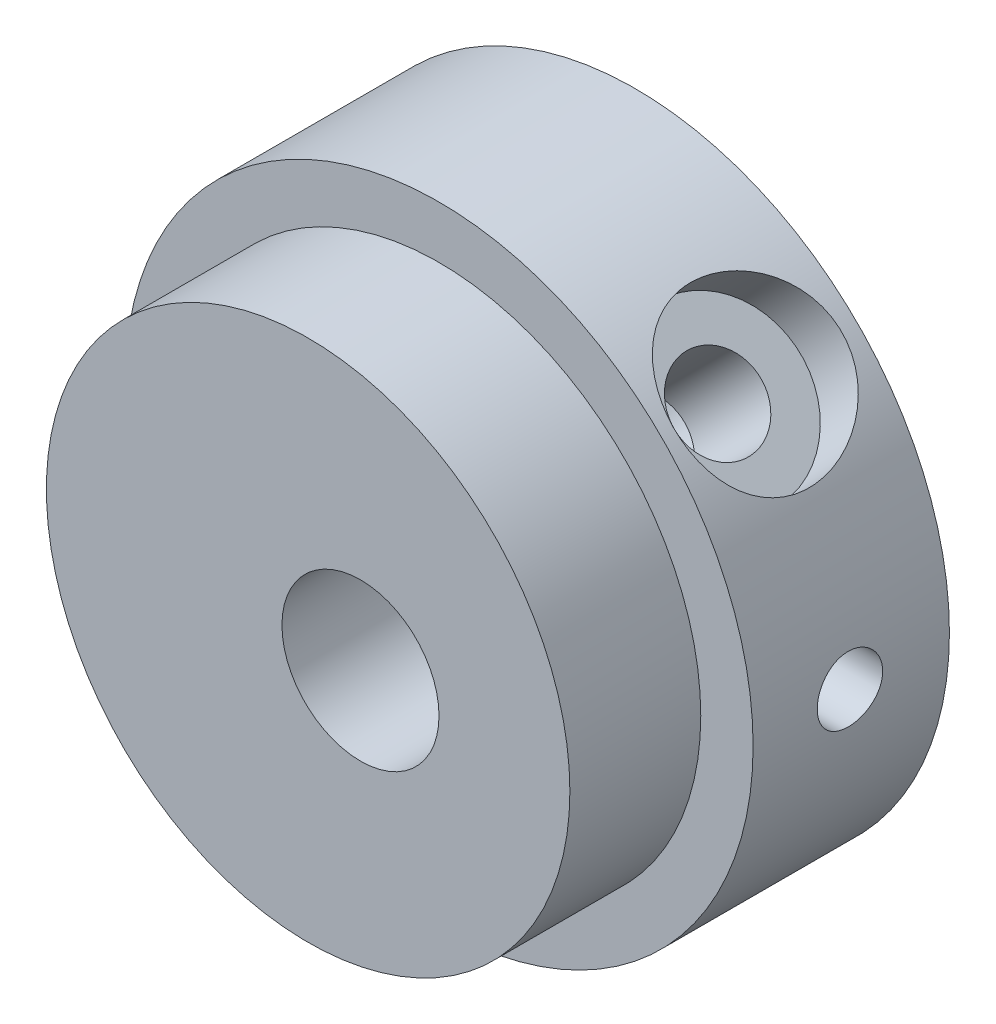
ISO-10303-21;
HEADER;
FILE_DESCRIPTION(('STEP AP214'),'2;1');
FILE_NAME('part.step','',(''),(''),'','','');
FILE_SCHEMA(('AUTOMOTIVE_DESIGN { 1 0 10303 214 1 1 1 1 }'));
ENDSEC;
DATA;
#1=APPLICATION_CONTEXT('core data for automotive mechanical design processes');
#2=APPLICATION_PROTOCOL_DEFINITION('international standard','automotive_design',2000,#1);
#3=PRODUCT_CONTEXT('',#1,'mechanical');
#4=PRODUCT('Part','Part','',(#3));
#5=PRODUCT_RELATED_PRODUCT_CATEGORY('part','',(#4));
#6=PRODUCT_DEFINITION_FORMATION('','',#4);
#7=PRODUCT_DEFINITION_CONTEXT('part definition',#1,'design');
#8=PRODUCT_DEFINITION('design','',#6,#7);
#9=PRODUCT_DEFINITION_SHAPE('','',#8);
#10=(LENGTH_UNIT() NAMED_UNIT(*) SI_UNIT(.MILLI.,.METRE.));
#11=(NAMED_UNIT(*) PLANE_ANGLE_UNIT() SI_UNIT($,.RADIAN.));
#12=(NAMED_UNIT(*) SI_UNIT($,.STERADIAN.) SOLID_ANGLE_UNIT());
#13=UNCERTAINTY_MEASURE_WITH_UNIT(LENGTH_MEASURE(1.E-05),#10,'distance_accuracy_value','');
#14=(GEOMETRIC_REPRESENTATION_CONTEXT(3) GLOBAL_UNCERTAINTY_ASSIGNED_CONTEXT((#13)) GLOBAL_UNIT_ASSIGNED_CONTEXT((#10,
#11,#12)) REPRESENTATION_CONTEXT('',''));
#15=CARTESIAN_POINT('',(0.,0.,0.));
#16=DIRECTION('',(0.,0.,1.));
#17=DIRECTION('',(1.,0.,0.));
#18=AXIS2_PLACEMENT_3D('',#15,#16,#17);
#19=CARTESIAN_POINT('',(0.,0.,19.05));
#20=DIRECTION('',(0.,0.,-1.));
#21=DIRECTION('',(-1.,0.,0.));
#22=AXIS2_PLACEMENT_3D('',#19,#20,#21);
#23=CYLINDRICAL_SURFACE('',#22,30.48);
#24=CARTESIAN_POINT('',(15.0179254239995,26.5234295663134,9.65064976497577));
#25=CARTESIAN_POINT('',(15.0179159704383,26.5234311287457,9.42649973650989));
#26=CARTESIAN_POINT('',(15.0262935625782,26.5186956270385,9.20242997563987));
#27=CARTESIAN_POINT('',(15.0596681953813,26.4997587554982,8.75587210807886));
#28=CARTESIAN_POINT('',(15.0846667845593,26.4855565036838,8.53338415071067));
#29=CARTESIAN_POINT('',(15.1509664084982,26.4476852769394,8.09162440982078));
#30=CARTESIAN_POINT('',(15.1922714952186,26.4240139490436,7.8723534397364));
#31=CARTESIAN_POINT('',(15.2906554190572,26.3672047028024,7.43854372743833));
#32=CARTESIAN_POINT('',(15.3477401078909,26.3340632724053,7.22400677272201));
#33=CARTESIAN_POINT('',(15.4768357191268,26.2583993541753,6.80161238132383));
#34=CARTESIAN_POINT('',(15.5488194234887,26.2158939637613,6.59374355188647));
#35=CARTESIAN_POINT('',(15.7069357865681,26.1214671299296,6.18557791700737));
#36=CARTESIAN_POINT('',(15.7930737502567,26.0695421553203,5.98528398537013));
#37=CARTESIAN_POINT('',(15.9784567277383,25.9563307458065,5.5937064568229));
#38=CARTESIAN_POINT('',(16.0776969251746,25.8950477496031,5.4024195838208));
#39=CARTESIAN_POINT('',(16.2882769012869,25.763110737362,5.02988582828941));
#40=CARTESIAN_POINT('',(16.3996222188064,25.6924524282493,4.84864359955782));
#41=CARTESIAN_POINT('',(16.6358736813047,25.5401311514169,4.49342521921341));
#42=CARTESIAN_POINT('',(16.761029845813,25.4582551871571,4.31970660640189));
#43=CARTESIAN_POINT('',(17.0214106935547,25.2849050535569,3.98521875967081));
#44=CARTESIAN_POINT('',(17.1566310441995,25.1934350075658,3.82444401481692));
#45=CARTESIAN_POINT('',(17.4359276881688,25.0009519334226,3.51672468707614));
#46=CARTESIAN_POINT('',(17.5800084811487,24.8999340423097,3.36978722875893));
#47=CARTESIAN_POINT('',(17.8755338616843,24.6886343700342,3.09087220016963));
#48=CARTESIAN_POINT('',(18.026975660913,24.5783560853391,2.95888902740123));
#49=CARTESIAN_POINT('',(18.3384180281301,24.3468904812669,2.70869080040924));
#50=CARTESIAN_POINT('',(18.4985185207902,24.2255533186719,2.59073852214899));
#51=CARTESIAN_POINT('',(18.8233666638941,23.9740160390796,2.37210765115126));
#52=CARTESIAN_POINT('',(18.9881126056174,23.8438191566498,2.27142280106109));
#53=CARTESIAN_POINT('',(19.3207949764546,23.5750505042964,2.0880713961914));
#54=CARTESIAN_POINT('',(19.4887315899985,23.4364782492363,2.00540588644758));
#55=CARTESIAN_POINT('',(19.8262527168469,23.1516490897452,1.85879720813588));
#56=CARTESIAN_POINT('',(19.9958371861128,23.0053923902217,1.79485354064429));
#57=CARTESIAN_POINT('',(20.3312427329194,22.709465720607,1.6874952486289));
#58=CARTESIAN_POINT('',(20.4970608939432,22.5599510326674,1.64364331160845));
#59=CARTESIAN_POINT('',(20.8274378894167,22.2553075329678,1.57472895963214));
#60=CARTESIAN_POINT('',(20.991996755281,22.1001788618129,1.54966607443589));
#61=CARTESIAN_POINT('',(21.3185088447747,21.7853850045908,1.51855466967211));
#62=CARTESIAN_POINT('',(21.4804624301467,21.6257204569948,1.51250348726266));
#63=CARTESIAN_POINT('',(21.800544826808,21.3030113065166,1.51946286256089));
#64=CARTESIAN_POINT('',(21.9586736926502,21.1399667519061,1.53247314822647));
#65=CARTESIAN_POINT('',(22.266002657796,20.8159581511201,1.57686331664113));
#66=CARTESIAN_POINT('',(22.4153276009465,20.6550469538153,1.60776667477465));
#67=CARTESIAN_POINT('',(22.7083840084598,20.3324176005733,1.68731589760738));
#68=CARTESIAN_POINT('',(22.8521135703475,20.1706991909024,1.73596773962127));
#69=CARTESIAN_POINT('',(23.1330671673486,19.8478559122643,1.8505953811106));
#70=CARTESIAN_POINT('',(23.2702932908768,19.6867308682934,1.91656557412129));
#71=CARTESIAN_POINT('',(23.5376573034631,19.3662762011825,2.06534504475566));
#72=CARTESIAN_POINT('',(23.6677925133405,19.2069472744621,2.14816063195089));
#73=CARTESIAN_POINT('',(23.9215719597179,18.8899553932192,2.33086376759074));
#74=CARTESIAN_POINT('',(24.0451421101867,18.7323229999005,2.43090719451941));
#75=CARTESIAN_POINT('',(24.284020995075,18.4215946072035,2.6468134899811));
#76=CARTESIAN_POINT('',(24.3993268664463,18.2685001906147,2.76268180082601));
#77=CARTESIAN_POINT('',(24.6212852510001,17.968237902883,3.00940734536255));
#78=CARTESIAN_POINT('',(24.7279378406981,17.8210699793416,3.14026444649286));
#79=CARTESIAN_POINT('',(24.932339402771,17.5339645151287,3.41610408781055));
#80=CARTESIAN_POINT('',(25.0300881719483,17.3940271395,3.56108695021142));
#81=CARTESIAN_POINT('',(25.2193898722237,17.1184573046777,3.86895256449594));
#82=CARTESIAN_POINT('',(25.3106572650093,16.9830922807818,4.03225054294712));
#83=CARTESIAN_POINT('',(25.4833746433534,16.7228110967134,4.37174735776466));
#84=CARTESIAN_POINT('',(25.5648278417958,16.5978915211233,4.54794194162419));
#85=CARTESIAN_POINT('',(25.7179005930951,16.3597079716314,4.91221559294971));
#86=CARTESIAN_POINT('',(25.7895158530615,16.2464490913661,5.10029979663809));
#87=CARTESIAN_POINT('',(25.9227901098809,16.0329408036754,5.48698012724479));
#88=CARTESIAN_POINT('',(25.9844529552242,15.9326863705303,5.68557215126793));
#89=CARTESIAN_POINT('',(26.0981964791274,15.7456852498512,6.09336226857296));
#90=CARTESIAN_POINT('',(26.1502110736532,15.6590323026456,6.3026218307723));
#91=CARTESIAN_POINT('',(26.2441083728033,15.5011488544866,6.72899375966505));
#92=CARTESIAN_POINT('',(26.2859948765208,15.4299125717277,6.94610314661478));
#93=CARTESIAN_POINT('',(26.3596428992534,15.3037566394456,7.38668876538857));
#94=CARTESIAN_POINT('',(26.3914045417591,15.2488367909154,7.61016491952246));
#95=CARTESIAN_POINT('',(26.4447887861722,15.1560686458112,8.06182160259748));
#96=CARTESIAN_POINT('',(26.4664116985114,15.1182198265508,8.2900019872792));
#97=CARTESIAN_POINT('',(26.499013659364,15.0610001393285,8.74243855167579));
#98=CARTESIAN_POINT('',(26.5102920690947,15.0411098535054,8.96660761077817));
#99=CARTESIAN_POINT('',(26.5232947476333,15.0181694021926,9.41608036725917));
#100=CARTESIAN_POINT('',(26.5250192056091,15.0151189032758,9.64138404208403));
#101=CARTESIAN_POINT('',(26.5189137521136,15.0258993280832,10.0914339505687));
#102=CARTESIAN_POINT('',(26.5110847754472,15.0397286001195,10.316180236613));
#103=CARTESIAN_POINT('',(26.485877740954,15.0840753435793,10.7634779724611));
#104=CARTESIAN_POINT('',(26.4684997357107,15.1145927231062,10.9860294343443));
#105=CARTESIAN_POINT('',(26.4246347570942,15.1911480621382,11.4230173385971));
#106=CARTESIAN_POINT('',(26.3983318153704,15.2368721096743,11.6375274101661));
#107=CARTESIAN_POINT('',(26.3365535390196,15.3434069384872,12.0614943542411));
#108=CARTESIAN_POINT('',(26.3010751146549,15.4042228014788,12.2709494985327));
#109=CARTESIAN_POINT('',(26.2209742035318,15.5401779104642,12.6832954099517));
#110=CARTESIAN_POINT('',(26.1763540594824,15.6153134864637,12.8861878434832));
#111=CARTESIAN_POINT('',(26.0779638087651,15.7790787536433,13.2842457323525));
#112=CARTESIAN_POINT('',(26.0241902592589,15.8677135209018,13.47940824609));
#113=CARTESIAN_POINT('',(25.9062645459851,16.0595392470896,13.8648526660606));
#114=CARTESIAN_POINT('',(25.8419128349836,16.1630038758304,14.0549373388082));
#115=CARTESIAN_POINT('',(25.7037115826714,16.3818913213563,14.4245643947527));
#116=CARTESIAN_POINT('',(25.6298587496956,16.4973182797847,14.6041030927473));
#117=CARTESIAN_POINT('',(25.4727331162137,16.7389075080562,14.951450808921));
#118=CARTESIAN_POINT('',(25.3894603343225,16.8650697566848,15.1192598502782));
#119=CARTESIAN_POINT('',(25.2135892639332,17.1268847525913,15.4421023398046));
#120=CARTESIAN_POINT('',(25.1209908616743,17.2625376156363,15.5971356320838));
#121=CARTESIAN_POINT('',(24.923770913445,17.546131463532,15.8977701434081));
#122=CARTESIAN_POINT('',(24.818877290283,17.6943155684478,16.0429638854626));
#123=CARTESIAN_POINT('',(24.5996289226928,17.9978802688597,16.3177174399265));
#124=CARTESIAN_POINT('',(24.4852774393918,18.1532583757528,16.4472826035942));
#125=CARTESIAN_POINT('',(24.2473617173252,18.4698419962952,16.6899406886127));
#126=CARTESIAN_POINT('',(24.1237942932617,18.6310495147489,16.8030278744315));
#127=CARTESIAN_POINT('',(23.8679705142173,18.9576736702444,17.011769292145));
#128=CARTESIAN_POINT('',(23.735717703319,19.1230885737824,17.1074305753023));
#129=CARTESIAN_POINT('',(23.4640345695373,19.4554674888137,17.2799798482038));
#130=CARTESIAN_POINT('',(23.3246629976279,19.6224116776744,17.3569984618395));
#131=CARTESIAN_POINT('',(23.0386298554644,19.9574654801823,17.4924806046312));
#132=CARTESIAN_POINT('',(22.8919710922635,20.1255746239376,17.5509512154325));
#133=CARTESIAN_POINT('',(22.5921649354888,20.4615535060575,17.6488673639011));
#134=CARTESIAN_POINT('',(22.4390175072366,20.6294232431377,17.6883127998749));
#135=CARTESIAN_POINT('',(22.1272357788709,20.9634928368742,17.7478212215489));
#136=CARTESIAN_POINT('',(21.9686016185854,21.1296927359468,17.7678847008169));
#137=CARTESIAN_POINT('',(21.6519348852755,21.453994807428,17.7881302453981));
#138=CARTESIAN_POINT('',(21.494033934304,21.6121888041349,17.7889049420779));
#139=CARTESIAN_POINT('',(21.1752894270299,21.9245823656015,17.7720691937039));
#140=CARTESIAN_POINT('',(21.0144458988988,22.0787819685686,17.7544589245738));
#141=CARTESIAN_POINT('',(20.6910543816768,22.3821317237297,17.7010072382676));
#142=CARTESIAN_POINT('',(20.5285064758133,22.5312821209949,17.6651667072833));
#143=CARTESIAN_POINT('',(20.202989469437,22.8236166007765,17.5755595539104));
#144=CARTESIAN_POINT('',(20.0400203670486,22.9668006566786,17.5217928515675));
#145=CARTESIAN_POINT('',(19.7161519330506,23.2454094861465,17.3972223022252));
#146=CARTESIAN_POINT('',(19.5552461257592,23.3808822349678,17.3265424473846));
#147=CARTESIAN_POINT('',(19.2356004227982,23.6445558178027,17.1684729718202));
#148=CARTESIAN_POINT('',(19.0768612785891,23.7727541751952,17.0810777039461));
#149=CARTESIAN_POINT('',(18.7629410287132,24.0212931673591,16.8902509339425));
#150=CARTESIAN_POINT('',(18.6077596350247,24.1416344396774,16.7868207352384));
#151=CARTESIAN_POINT('',(18.3022465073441,24.3740645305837,16.5646459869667));
#152=CARTESIAN_POINT('',(18.1519150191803,24.4861529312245,16.4459006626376));
#153=CARTESIAN_POINT('',(17.8534658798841,24.7046406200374,16.1905303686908));
#154=CARTESIAN_POINT('',(17.7055144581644,24.8108081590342,16.0535127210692));
#155=CARTESIAN_POINT('',(17.4174613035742,25.0138661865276,15.7651060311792));
#156=CARTESIAN_POINT('',(17.2773596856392,25.1107565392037,15.6137167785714));
#157=CARTESIAN_POINT('',(17.0063063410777,25.295114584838,15.2975139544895));
#158=CARTESIAN_POINT('',(16.8753570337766,25.3825797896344,15.1326968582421));
#159=CARTESIAN_POINT('',(16.6239486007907,25.5479427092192,14.7907300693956));
#160=CARTESIAN_POINT('',(16.5034892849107,25.6258405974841,14.613580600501));
#161=CARTESIAN_POINT('',(16.2717471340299,25.7736291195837,14.243986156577));
#162=CARTESIAN_POINT('',(16.1607288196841,25.8433024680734,14.0512881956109));
#163=CARTESIAN_POINT('',(15.952260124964,25.9725015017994,13.6555328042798));
#164=CARTESIAN_POINT('',(15.8548047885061,26.0320308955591,13.4524791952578));
#165=CARTESIAN_POINT('',(15.6746176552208,26.1409230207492,13.0373914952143));
#166=CARTESIAN_POINT('',(15.5918804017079,26.1902895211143,12.825360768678));
#167=CARTESIAN_POINT('',(15.4421513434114,26.2788487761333,12.3938230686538));
#168=CARTESIAN_POINT('',(15.3751573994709,26.3180429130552,12.1743171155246));
#169=CARTESIAN_POINT('',(15.2183317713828,26.4092016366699,11.5796056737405));
#170=CARTESIAN_POINT('',(15.1434137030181,26.4520442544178,11.1989103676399));
#171=CARTESIAN_POINT('',(15.0432215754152,26.5091552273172,10.4289453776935));
#172=CARTESIAN_POINT('',(15.0179418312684,26.5234268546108,10.0396766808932));
#173=CARTESIAN_POINT('',(15.0179254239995,26.5234295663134,9.65064976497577));
#174=B_SPLINE_CURVE_WITH_KNOTS('',3,(#24,#25,#26,#27,#28,#29,#30,#31,#32,#33,#34,#35,#36,#37,
#38,#39,#40,#41,#42,#43,#44,#45,#46,#47,#48,#49,#50,#51,#52,#53,#54,#55,#56,#57,#58,#59,#60,#61,
#62,#63,#64,#65,#66,#67,#68,#69,#70,#71,#72,#73,#74,#75,#76,#77,#78,#79,#80,#81,#82,#83,#84,#85,
#86,#87,#88,#89,#90,#91,#92,#93,#94,#95,#96,#97,#98,#99,#100,#101,#102,#103,#104,#105,#106,#107,
#108,#109,#110,#111,#112,#113,#114,#115,#116,#117,#118,#119,#120,#121,#122,#123,#124,#125,#126,
#127,#128,#129,#130,#131,#132,#133,#134,#135,#136,#137,#138,#139,#140,#141,#142,#143,#144,#145,
#146,#147,#148,#149,#150,#151,#152,#153,#154,#155,#156,#157,#158,#159,#160,#161,#162,#163,#164,
#165,#166,#167,#168,#169,#170,#171,#172,#173),.UNSPECIFIED.,.T.,.F.,(4,2,2,2,2,2,2,2,2,2,2,2,2,
2,2,2,2,2,2,2,2,2,2,2,2,2,2,2,2,2,2,2,2,2,2,2,2,2,2,2,2,2,2,2,2,2,2,2,2,2,2,2,2,2,2,2,2,2,2,2,2,
2,2,2,2,2,2,2,2,2,2,2,2,2,4),(0.,0.672105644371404,1.34427391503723,2.01660931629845,
2.68919438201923,3.36056142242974,4.03218066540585,4.70355370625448,5.37523524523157,
6.06212953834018,6.74872981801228,7.43568170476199,8.12237537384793,8.82038696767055,
9.51814507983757,10.215943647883,10.9137236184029,11.5954954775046,12.2772502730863,
12.9589095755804,13.6405591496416,14.3048395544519,14.9693438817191,15.6336333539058,
16.2981721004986,16.9690741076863,17.6402074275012,18.3113348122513,18.9824775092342,
19.6743999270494,20.3660952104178,21.0580913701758,21.7498192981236,22.4461229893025,
23.1421650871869,23.838198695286,24.5342109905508,25.209379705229,25.8845350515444,
26.5596243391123,27.2347099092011,27.8966451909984,28.5588036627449,29.2207926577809,
29.8830311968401,30.5596117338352,31.2364273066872,31.9132415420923,32.5900640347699,
33.286645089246,33.9829869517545,34.6795706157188,35.3758717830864,36.0671429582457,
36.758149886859,37.4491605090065,38.1401535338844,38.8098892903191,39.4796186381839,
40.1493154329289,40.8190152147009,41.4839481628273,42.1491061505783,42.8142100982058,
43.4793477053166,44.1622412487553,44.8451447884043,45.5282281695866,46.21129916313,
46.9096017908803,47.6076485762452,48.3054360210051,49.0031285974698,50.1697451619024,
51.3362281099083),.UNSPECIFIED.);
#175=CARTESIAN_POINT('',(15.0179254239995,26.5234295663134,9.65064976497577));
#176=VERTEX_POINT('',#175);
#177=EDGE_CURVE('E11',#176,#176,#174,.T.);
#178=ORIENTED_EDGE('',*,*,#177,.T.);
#179=EDGE_LOOP('',(#178));
#180=FACE_BOUND('',#179,.T.);
#181=CARTESIAN_POINT('',(0.,0.,19.05));
#182=DIRECTION('',(0.,0.,1.));
#183=DIRECTION('',(1.,0.,0.));
#184=AXIS2_PLACEMENT_3D('',#181,#182,#183);
#185=CIRCLE('',#184,30.48);
#186=CARTESIAN_POINT('',(30.48,0.,19.05));
#187=VERTEX_POINT('',#186);
#188=EDGE_CURVE('E43',#187,#187,#185,.T.);
#189=ORIENTED_EDGE('',*,*,#188,.F.);
#190=EDGE_LOOP('',(#189));
#191=FACE_BOUND('',#190,.T.);
#192=CARTESIAN_POINT('',(0.,0.,0.));
#193=DIRECTION('',(0.,0.,1.));
#194=DIRECTION('',(1.,0.,0.));
#195=AXIS2_PLACEMENT_3D('',#192,#193,#194);
#196=CIRCLE('',#195,30.48);
#197=CARTESIAN_POINT('',(30.48,0.,0.));
#198=VERTEX_POINT('',#197);
#199=EDGE_CURVE('E91',#198,#198,#196,.T.);
#200=ORIENTED_EDGE('',*,*,#199,.T.);
#201=EDGE_LOOP('',(#200));
#202=FACE_BOUND('',#201,.T.);
#203=CARTESIAN_POINT('',(30.48,0.,12.827));
#204=CARTESIAN_POINT('',(30.4799978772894,-0.177824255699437,12.8269923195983));
#205=CARTESIAN_POINT('',(30.478427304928,-0.355765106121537,12.8120104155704));
#206=CARTESIAN_POINT('',(30.4723130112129,-0.706710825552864,12.7524723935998));
#207=CARTESIAN_POINT('',(30.4677660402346,-0.879710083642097,12.7078839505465));
#208=CARTESIAN_POINT('',(30.4562120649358,-1.21563996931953,12.5904473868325));
#209=CARTESIAN_POINT('',(30.4492065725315,-1.3785767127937,12.5176166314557));
#210=CARTESIAN_POINT('',(30.433518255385,-1.68987851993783,12.3457972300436));
#211=CARTESIAN_POINT('',(30.424835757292,-1.83824641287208,12.2468136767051));
#212=CARTESIAN_POINT('',(30.4067277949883,-2.11681063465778,12.0250856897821));
#213=CARTESIAN_POINT('',(30.39729986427,-2.24694231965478,11.9022602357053));
#214=CARTESIAN_POINT('',(30.3787839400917,-2.48478436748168,11.6365080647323));
#215=CARTESIAN_POINT('',(30.3696959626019,-2.5924936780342,11.4935804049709));
#216=CARTESIAN_POINT('',(30.3528638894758,-2.78266447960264,11.1912737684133));
#217=CARTESIAN_POINT('',(30.3451229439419,-2.86506712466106,11.031857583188));
#218=CARTESIAN_POINT('',(30.331892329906,-3.00190973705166,10.7013567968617));
#219=CARTESIAN_POINT('',(30.3264026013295,-3.05635045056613,10.5302725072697));
#220=CARTESIAN_POINT('',(30.318318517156,-3.13553136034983,10.181953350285));
#221=CARTESIAN_POINT('',(30.3157136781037,-3.16037912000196,10.0047431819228));
#222=CARTESIAN_POINT('',(30.3136618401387,-3.18000133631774,9.64865010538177));
#223=CARTESIAN_POINT('',(30.3142147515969,-3.17477664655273,9.46976724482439));
#224=CARTESIAN_POINT('',(30.3184063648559,-3.13449087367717,9.11614930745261));
#225=CARTESIAN_POINT('',(30.3220329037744,-3.09954739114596,8.94140066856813));
#226=CARTESIAN_POINT('',(30.3319441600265,-3.00099900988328,8.60026179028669));
#227=CARTESIAN_POINT('',(30.3382289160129,-2.93739369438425,8.43387167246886));
#228=CARTESIAN_POINT('',(30.3527624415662,-2.78319787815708,8.11380247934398));
#229=CARTESIAN_POINT('',(30.3610149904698,-2.69255536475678,7.96014864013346));
#230=CARTESIAN_POINT('',(30.3785510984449,-2.48689550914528,7.67018988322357));
#231=CARTESIAN_POINT('',(30.3878346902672,-2.37187739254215,7.53388551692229));
#232=CARTESIAN_POINT('',(30.4064410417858,-2.12007521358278,7.28181163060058));
#233=CARTESIAN_POINT('',(30.4157637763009,-1.98318961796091,7.16614350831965));
#234=CARTESIAN_POINT('',(30.4333560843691,-1.69189027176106,6.9594119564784));
#235=CARTESIAN_POINT('',(30.4416256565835,-1.53747649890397,6.86834855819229));
#236=CARTESIAN_POINT('',(30.4561829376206,-1.21543258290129,6.71341485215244));
#237=CARTESIAN_POINT('',(30.4624702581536,-1.04779985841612,6.64954987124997));
#238=CARTESIAN_POINT('',(30.4723507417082,-0.704110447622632,6.55090113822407));
#239=CARTESIAN_POINT('',(30.4759439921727,-0.52805403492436,6.51611644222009));
#240=CARTESIAN_POINT('',(30.4800202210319,-0.173392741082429,6.47674474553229));
#241=CARTESIAN_POINT('',(30.4805176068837,0.00519645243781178,6.47201786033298));
#242=CARTESIAN_POINT('',(30.4783847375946,0.360624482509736,6.49252829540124));
#243=CARTESIAN_POINT('',(30.4757545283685,0.537463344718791,6.51776517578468));
#244=CARTESIAN_POINT('',(30.4676711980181,0.883965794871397,6.59737068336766));
#245=CARTESIAN_POINT('',(30.4622244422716,1.05364463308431,6.65167363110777));
#246=CARTESIAN_POINT('',(30.4491188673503,1.38148497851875,6.78780219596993));
#247=CARTESIAN_POINT('',(30.4414599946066,1.53964620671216,6.86962847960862));
#248=CARTESIAN_POINT('',(30.4247505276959,1.84059301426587,7.05882659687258));
#249=CARTESIAN_POINT('',(30.4156949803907,1.98332066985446,7.16629012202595));
#250=CARTESIAN_POINT('',(30.3972236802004,2.24876203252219,7.40358102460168));
#251=CARTESIAN_POINT('',(30.3878079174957,2.37147519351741,7.53340901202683));
#252=CARTESIAN_POINT('',(30.3696338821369,2.59389150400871,7.81235476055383));
#253=CARTESIAN_POINT('',(30.3608783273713,2.69350270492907,7.96154603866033));
#254=CARTESIAN_POINT('',(30.3450579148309,2.86625493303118,8.27462166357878));
#255=CARTESIAN_POINT('',(30.3379930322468,2.93939634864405,8.43850579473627));
#256=CARTESIAN_POINT('',(30.3263710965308,3.05697962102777,8.77600255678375));
#257=CARTESIAN_POINT('',(30.3218093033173,3.10147575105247,8.94959610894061));
#258=CARTESIAN_POINT('',(30.3156955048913,3.16068128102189,9.3018406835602));
#259=CARTESIAN_POINT('',(30.3141434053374,3.17539161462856,9.48049154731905));
#260=CARTESIAN_POINT('',(30.3142268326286,3.17459439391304,9.83686549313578));
#261=CARTESIAN_POINT('',(30.3158471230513,3.15923127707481,10.0145889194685));
#262=CARTESIAN_POINT('',(30.3220602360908,3.09902655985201,10.3649150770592));
#263=CARTESIAN_POINT('',(30.3266530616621,3.05418493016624,10.5375178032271));
#264=CARTESIAN_POINT('',(30.3382894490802,2.93633676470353,10.8726991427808));
#265=CARTESIAN_POINT('',(30.3453326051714,2.86333489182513,11.0352794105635));
#266=CARTESIAN_POINT('',(30.3610768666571,2.69125321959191,11.34590289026));
#267=CARTESIAN_POINT('',(30.3697779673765,2.59217349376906,11.4939461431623));
#268=CARTESIAN_POINT('',(30.387907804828,2.37020693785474,11.7720333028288));
#269=CARTESIAN_POINT('',(30.3973397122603,2.24721241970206,11.9019910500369));
#270=CARTESIAN_POINT('',(30.4158395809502,1.98112345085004,12.139484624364));
#271=CARTESIAN_POINT('',(30.4249074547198,1.83802420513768,12.2470150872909));
#272=CARTESIAN_POINT('',(30.4416833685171,1.53536009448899,12.4368342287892));
#273=CARTESIAN_POINT('',(30.4493876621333,1.37575171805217,12.5190538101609));
#274=CARTESIAN_POINT('',(30.4625281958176,1.04501402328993,12.6554140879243));
#275=CARTESIAN_POINT('',(30.4679669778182,0.873897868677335,12.7095862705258));
#276=CARTESIAN_POINT('',(30.4746054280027,0.584854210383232,12.7748872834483));
#277=CARTESIAN_POINT('',(30.4766188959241,0.468770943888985,12.7944026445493));
#278=CARTESIAN_POINT('',(30.4793168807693,0.235142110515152,12.8204615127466));
#279=CARTESIAN_POINT('',(30.4800014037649,0.117596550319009,12.8270050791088));
#280=CARTESIAN_POINT('',(30.48,0.,12.827));
#281=B_SPLINE_CURVE_WITH_KNOTS('',3,(#203,#204,#205,#206,#207,#208,#209,#210,#211,#212,#213,
#214,#215,#216,#217,#218,#219,#220,#221,#222,#223,#224,#225,#226,#227,#228,#229,#230,#231,#232,
#233,#234,#235,#236,#237,#238,#239,#240,#241,#242,#243,#244,#245,#246,#247,#248,#249,#250,#251,
#252,#253,#254,#255,#256,#257,#258,#259,#260,#261,#262,#263,#264,#265,#266,#267,#268,#269,#270,
#271,#272,#273,#274,#275,#276,#277,#278,#279,#280),.UNSPECIFIED.,.T.,.F.,(4,2,2,2,2,2,2,2,2,2,2,
2,2,2,2,2,2,2,2,2,2,2,2,2,2,2,2,2,2,2,2,2,2,2,2,2,2,2,4),(0.,0.533043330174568,1.06666960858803,
1.59996829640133,2.13316321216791,2.66820281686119,3.2032675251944,3.73956716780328,
4.27585249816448,4.81018255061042,5.3444974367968,5.87670776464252,6.40892583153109,
6.94217442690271,7.47543996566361,8.01125761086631,8.54707593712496,9.08299915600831,
9.61890497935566,10.1523149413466,10.6857170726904,11.2179189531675,11.7501337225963,
12.2842812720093,12.8184433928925,13.3546963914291,13.8909415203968,14.4261676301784,
14.9613769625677,15.4940220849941,16.0266677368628,16.5592252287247,17.0917812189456,
17.6267932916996,18.1619331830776,18.6985212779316,19.2345056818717,19.5870129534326,
19.9395186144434),.UNSPECIFIED.);
#282=CARTESIAN_POINT('',(30.48,0.,12.827));
#283=VERTEX_POINT('',#282);
#284=EDGE_CURVE('E60',#283,#283,#281,.T.);
#285=ORIENTED_EDGE('',*,*,#284,.F.);
#286=EDGE_LOOP('',(#285));
#287=FACE_BOUND('',#286,.T.);
#288=ADVANCED_FACE('F33',(#180,#191,#202,#287),#23,.T.);
#289=CARTESIAN_POINT('',(5.08,0.,47.752));
#290=DIRECTION('',(0.,0.,-1.));
#291=DIRECTION('',(-1.,0.,0.));
#292=AXIS2_PLACEMENT_3D('',#289,#290,#291);
#293=CYLINDRICAL_SURFACE('',#292,7.62);
#294=CARTESIAN_POINT('',(5.08,0.,31.75));
#295=DIRECTION('',(0.,0.,1.));
#296=DIRECTION('',(1.,0.,0.));
#297=AXIS2_PLACEMENT_3D('',#294,#295,#296);
#298=CIRCLE('',#297,7.62);
#299=CARTESIAN_POINT('',(12.7,0.,31.75));
#300=VERTEX_POINT('',#299);
#301=EDGE_CURVE('E87',#300,#300,#298,.T.);
#302=ORIENTED_EDGE('',*,*,#301,.T.);
#303=EDGE_LOOP('',(#302));
#304=FACE_BOUND('',#303,.T.);
#305=CARTESIAN_POINT('',(5.08,0.,0.));
#306=DIRECTION('',(0.,0.,-1.));
#307=DIRECTION('',(-1.,0.,0.));
#308=AXIS2_PLACEMENT_3D('',#305,#306,#307);
#309=CIRCLE('',#308,7.62);
#310=CARTESIAN_POINT('',(-2.54,0.,0.));
#311=VERTEX_POINT('',#310);
#312=EDGE_CURVE('E71',#311,#311,#309,.T.);
#313=ORIENTED_EDGE('',*,*,#312,.T.);
#314=EDGE_LOOP('',(#313));
#315=FACE_BOUND('',#314,.T.);
#316=CARTESIAN_POINT('',(12.7,0.,12.827));
#317=CARTESIAN_POINT('',(12.6999946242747,0.170055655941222,12.8269931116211));
#318=CARTESIAN_POINT('',(12.6942423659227,0.340409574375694,12.8132566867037));
#319=CARTESIAN_POINT('',(12.6718076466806,0.676273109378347,12.7588257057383));
#320=CARTESIAN_POINT('',(12.6550966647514,0.841768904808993,12.7180608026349));
#321=CARTESIAN_POINT('',(12.6125303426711,1.16252810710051,12.6113266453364));
#322=CARTESIAN_POINT('',(12.5867060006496,1.31782410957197,12.5454427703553));
#323=CARTESIAN_POINT('',(12.5284301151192,1.61500792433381,12.3906968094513));
#324=CARTESIAN_POINT('',(12.4959805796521,1.75689978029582,12.3018416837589));
#325=CARTESIAN_POINT('',(12.4258788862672,2.03059884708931,12.0989624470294));
#326=CARTESIAN_POINT('',(12.3880563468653,2.16164479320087,11.9839706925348));
#327=CARTESIAN_POINT('',(12.3122109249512,2.40324597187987,11.7341285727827));
#328=CARTESIAN_POINT('',(12.2741879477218,2.51379041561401,11.5992678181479));
#329=CARTESIAN_POINT('',(12.2001539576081,2.71662492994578,11.3054719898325));
#330=CARTESIAN_POINT('',(12.164333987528,2.80774922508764,11.1456788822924));
#331=CARTESIAN_POINT('',(12.1014635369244,2.96148609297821,10.8113239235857));
#332=CARTESIAN_POINT('',(12.074408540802,3.02411335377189,10.6367697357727));
#333=CARTESIAN_POINT('',(12.0339753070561,3.11593479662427,10.2866096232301));
#334=CARTESIAN_POINT('',(12.020001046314,3.14659410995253,10.1114593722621));
#335=CARTESIAN_POINT('',(12.0055976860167,3.17818033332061,9.75798583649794));
#336=CARTESIAN_POINT('',(12.005161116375,3.17912364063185,9.57966435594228));
#337=CARTESIAN_POINT('',(12.0173780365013,3.15235463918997,9.239503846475));
#338=CARTESIAN_POINT('',(12.0290306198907,3.12683350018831,9.07744921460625));
#339=CARTESIAN_POINT('',(12.0624214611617,3.05153545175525,8.76017528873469));
#340=CARTESIAN_POINT('',(12.0841616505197,3.00175389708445,8.60495730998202));
#341=CARTESIAN_POINT('',(12.1357690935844,2.87837775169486,8.3018434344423));
#342=CARTESIAN_POINT('',(12.1657994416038,2.80429897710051,8.15417363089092));
#343=CARTESIAN_POINT('',(12.2305656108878,2.63477356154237,7.87278655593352));
#344=CARTESIAN_POINT('',(12.2653032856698,2.53931849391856,7.73907481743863));
#345=CARTESIAN_POINT('',(12.3391416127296,2.32027975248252,7.47750610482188));
#346=CARTESIAN_POINT('',(12.3783628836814,2.19500064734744,7.35109891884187));
#347=CARTESIAN_POINT('',(12.4542720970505,1.92463316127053,7.12060170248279));
#348=CARTESIAN_POINT('',(12.490959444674,1.779540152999,7.01651689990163));
#349=CARTESIAN_POINT('',(12.5587324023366,1.46925778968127,6.83149300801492));
#350=CARTESIAN_POINT('',(12.5896691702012,1.30368187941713,6.75114360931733));
#351=CARTESIAN_POINT('',(12.6413128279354,0.959745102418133,6.61994830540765));
#352=CARTESIAN_POINT('',(12.6620253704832,0.781391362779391,6.56908609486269));
#353=CARTESIAN_POINT('',(12.6898308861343,0.429077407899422,6.50134337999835));
#354=CARTESIAN_POINT('',(12.697702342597,0.255552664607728,6.48251724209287));
#355=CARTESIAN_POINT('',(12.7014236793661,-0.0923408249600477,6.4735805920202));
#356=CARTESIAN_POINT('',(12.6972770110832,-0.266709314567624,6.48346183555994));
#357=CARTESIAN_POINT('',(12.6779329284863,-0.602229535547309,6.53026655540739));
#358=CARTESIAN_POINT('',(12.6632941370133,-0.76360773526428,6.5658236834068));
#359=CARTESIAN_POINT('',(12.6250346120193,-1.07793218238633,6.66106921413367));
#360=CARTESIAN_POINT('',(12.6014127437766,-1.23087736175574,6.72076066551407));
#361=CARTESIAN_POINT('',(12.5465400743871,-1.52935685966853,6.86453027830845));
#362=CARTESIAN_POINT('',(12.5150750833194,-1.67451338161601,6.94930838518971));
#363=CARTESIAN_POINT('',(12.4478746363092,-1.94905938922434,7.14007557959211));
#364=CARTESIAN_POINT('',(12.4121373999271,-2.0784422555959,7.24607352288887));
#365=CARTESIAN_POINT('',(12.3370870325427,-2.3274869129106,7.48513421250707));
#366=CARTESIAN_POINT('',(12.2977008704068,-2.44579317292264,7.61958979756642));
#367=CARTESIAN_POINT('',(12.2220821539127,-2.65854140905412,7.90707404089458));
#368=CARTESIAN_POINT('',(12.1858503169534,-2.75297796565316,8.06010690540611));
#369=CARTESIAN_POINT('',(12.120407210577,-2.91632538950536,8.38356000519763));
#370=CARTESIAN_POINT('',(12.0913032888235,-2.98485352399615,8.55419684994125));
#371=CARTESIAN_POINT('',(12.0448922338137,-3.09162231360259,8.90618130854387));
#372=CARTESIAN_POINT('',(12.0275753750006,-3.12988794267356,9.08751995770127));
#373=CARTESIAN_POINT('',(12.0081843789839,-3.17256364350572,9.4407194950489));
#374=CARTESIAN_POINT('',(12.0050395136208,-3.17935307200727,9.61223543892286));
#375=CARTESIAN_POINT('',(12.011503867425,-3.16523560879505,9.95386087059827));
#376=CARTESIAN_POINT('',(12.021111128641,-3.14433296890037,10.1239705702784));
#377=CARTESIAN_POINT('',(12.0510185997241,-3.0774235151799,10.4497955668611));
#378=CARTESIAN_POINT('',(12.0708002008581,-3.0326306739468,10.6058123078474));
#379=CARTESIAN_POINT('',(12.1184208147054,-2.92039861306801,10.908152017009));
#380=CARTESIAN_POINT('',(12.1462620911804,-2.85295302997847,11.0544722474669));
#381=CARTESIAN_POINT('',(12.208940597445,-2.69266174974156,11.3428674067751));
#382=CARTESIAN_POINT('',(12.244097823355,-2.59853263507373,11.4841580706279));
#383=CARTESIAN_POINT('',(12.3165538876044,-2.38933567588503,11.7496854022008));
#384=CARTESIAN_POINT('',(12.3538534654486,-2.27426057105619,11.8739161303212));
#385=CARTESIAN_POINT('',(12.429651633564,-2.01651869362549,12.1110950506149));
#386=CARTESIAN_POINT('',(12.4680396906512,-1.87245277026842,12.222562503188));
#387=CARTESIAN_POINT('',(12.5389705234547,-1.5661352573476,12.4198466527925));
#388=CARTESIAN_POINT('',(12.5715106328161,-1.40387542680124,12.5056516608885));
#389=CARTESIAN_POINT('',(12.6129313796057,-1.15174154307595,12.6121185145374));
#390=CARTESIAN_POINT('',(12.6254368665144,-1.06693676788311,12.6437375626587));
#391=CARTESIAN_POINT('',(12.6477973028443,-0.89463223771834,12.6996951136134));
#392=CARTESIAN_POINT('',(12.657653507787,-0.807133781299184,12.7240370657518));
#393=CARTESIAN_POINT('',(12.6744027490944,-0.630332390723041,12.7651218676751));
#394=CARTESIAN_POINT('',(12.6813031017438,-0.54103449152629,12.7818834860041));
#395=CARTESIAN_POINT('',(12.6919671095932,-0.361190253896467,12.807694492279));
#396=CARTESIAN_POINT('',(12.6957330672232,-0.270644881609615,12.8167495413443));
#397=CARTESIAN_POINT('',(12.698583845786,-0.149930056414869,12.8235999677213));
#398=CARTESIAN_POINT('',(12.6991144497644,-0.119961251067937,12.8248744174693));
#399=CARTESIAN_POINT('',(12.6998230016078,-0.0599980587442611,12.8265750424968));
#400=CARTESIAN_POINT('',(12.700000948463,-0.0300036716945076,12.8270012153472));
#401=CARTESIAN_POINT('',(12.7,0.,12.827));
#402=B_SPLINE_CURVE_WITH_KNOTS('',3,(#316,#317,#318,#319,#320,#321,#322,#323,#324,#325,#326,
#327,#328,#329,#330,#331,#332,#333,#334,#335,#336,#337,#338,#339,#340,#341,#342,#343,#344,#345,
#346,#347,#348,#349,#350,#351,#352,#353,#354,#355,#356,#357,#358,#359,#360,#361,#362,#363,#364,
#365,#366,#367,#368,#369,#370,#371,#372,#373,#374,#375,#376,#377,#378,#379,#380,#381,#382,#383,
#384,#385,#386,#387,#388,#389,#390,#391,#392,#393,#394,#395,#396,#397,#398,#399,#400,#401),
.UNSPECIFIED.,.T.,.F.,(4,2,2,2,2,2,2,2,2,2,2,2,2,2,2,2,2,2,2,2,2,2,2,2,2,2,2,2,2,2,2,2,2,2,2,2,
2,2,2,2,2,2,4),(0.,0.510049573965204,1.02143189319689,1.53109130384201,2.04059646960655,
2.5734755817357,3.10663432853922,3.66602580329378,4.22512862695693,4.75729993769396,
5.28917759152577,5.78028199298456,6.27148046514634,6.77313131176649,7.27498026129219,
7.81924118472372,8.36362943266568,8.92058299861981,9.47722829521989,9.99867046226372,
10.5199628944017,11.0153853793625,11.5108704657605,12.021747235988,12.5328376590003,
13.0804535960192,13.6281937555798,14.1837356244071,14.7388185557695,15.2511728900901,
15.7634485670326,16.2518763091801,16.7404413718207,17.2583828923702,17.7765042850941,
18.3323619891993,18.8884724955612,19.1622724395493,19.4359423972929,19.7089310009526,
19.9817188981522,20.0717089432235,20.1616992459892),.UNSPECIFIED.);
#403=CARTESIAN_POINT('',(12.7,0.,12.827));
#404=VERTEX_POINT('',#403);
#405=EDGE_CURVE('E56',#404,#404,#402,.T.);
#406=ORIENTED_EDGE('',*,*,#405,.F.);
#407=EDGE_LOOP('',(#406));
#408=FACE_BOUND('',#407,.T.);
#409=ADVANCED_FACE('F80',(#304,#315,#408),#293,.F.);
#410=CARTESIAN_POINT('',(0.,0.,19.05));
#411=DIRECTION('',(0.,0.,1.));
#412=DIRECTION('',(1.,0.,0.));
#413=AXIS2_PLACEMENT_3D('',#410,#411,#412);
#414=PLANE('',#413);
#415=CARTESIAN_POINT('',(0.,0.,19.05));
#416=DIRECTION('',(0.,0.,1.));
#417=DIRECTION('',(1.,0.,0.));
#418=AXIS2_PLACEMENT_3D('',#415,#416,#417);
#419=CIRCLE('',#418,25.4);
#420=CARTESIAN_POINT('',(25.4,0.,19.05));
#421=VERTEX_POINT('',#420);
#422=EDGE_CURVE('E90',#421,#421,#419,.T.);
#423=ORIENTED_EDGE('',*,*,#422,.F.);
#424=EDGE_LOOP('',(#423));
#425=FACE_BOUND('',#424,.T.);
#426=ORIENTED_EDGE('',*,*,#188,.T.);
#427=EDGE_LOOP('',(#426));
#428=FACE_BOUND('',#427,.T.);
#429=ADVANCED_FACE('F109',(#425,#428),#414,.T.);
#430=CARTESIAN_POINT('',(0.,0.,0.));
#431=DIRECTION('',(0.,0.,1.));
#432=DIRECTION('',(1.,0.,0.));
#433=AXIS2_PLACEMENT_3D('',#430,#431,#432);
#434=PLANE('',#433);
#435=ORIENTED_EDGE('',*,*,#312,.F.);
#436=EDGE_LOOP('',(#435));
#437=FACE_BOUND('',#436,.T.);
#438=ORIENTED_EDGE('',*,*,#199,.F.);
#439=EDGE_LOOP('',(#438));
#440=FACE_BOUND('',#439,.T.);
#441=ADVANCED_FACE('F105',(#437,#440),#434,.F.);
#442=CARTESIAN_POINT('',(0.,0.,31.75));
#443=DIRECTION('',(0.,0.,-1.));
#444=DIRECTION('',(-1.,0.,0.));
#445=AXIS2_PLACEMENT_3D('',#442,#443,#444);
#446=CYLINDRICAL_SURFACE('',#445,25.4);
#447=CARTESIAN_POINT('',(0.,0.,31.75));
#448=DIRECTION('',(0.,0.,1.));
#449=DIRECTION('',(1.,0.,0.));
#450=AXIS2_PLACEMENT_3D('',#447,#448,#449);
#451=CIRCLE('',#450,25.4);
#452=CARTESIAN_POINT('',(25.4,0.,31.75));
#453=VERTEX_POINT('',#452);
#454=EDGE_CURVE('E94',#453,#453,#451,.T.);
#455=ORIENTED_EDGE('',*,*,#454,.F.);
#456=EDGE_LOOP('',(#455));
#457=FACE_BOUND('',#456,.T.);
#458=ORIENTED_EDGE('',*,*,#422,.T.);
#459=EDGE_LOOP('',(#458));
#460=FACE_BOUND('',#459,.T.);
#461=ADVANCED_FACE('F102',(#457,#460),#446,.T.);
#462=CARTESIAN_POINT('',(0.,0.,31.75));
#463=DIRECTION('',(0.,0.,1.));
#464=DIRECTION('',(1.,0.,0.));
#465=AXIS2_PLACEMENT_3D('',#462,#463,#464);
#466=PLANE('',#465);
#467=ORIENTED_EDGE('',*,*,#301,.F.);
#468=EDGE_LOOP('',(#467));
#469=FACE_BOUND('',#468,.T.);
#470=ORIENTED_EDGE('',*,*,#454,.T.);
#471=EDGE_LOOP('',(#470));
#472=FACE_BOUND('',#471,.T.);
#473=ADVANCED_FACE('F77',(#469,#472),#466,.T.);
#474=CARTESIAN_POINT('',(47.752,0.,9.652));
#475=DIRECTION('',(-1.,0.,0.));
#476=DIRECTION('',(0.,0.,1.));
#477=AXIS2_PLACEMENT_3D('',#474,#475,#476);
#478=CYLINDRICAL_SURFACE('',#477,3.175);
#479=ORIENTED_EDGE('',*,*,#405,.T.);
#480=EDGE_LOOP('',(#479));
#481=FACE_BOUND('',#480,.T.);
#482=ORIENTED_EDGE('',*,*,#284,.T.);
#483=EDGE_LOOP('',(#482));
#484=FACE_BOUND('',#483,.T.);
#485=ADVANCED_FACE('F73',(#481,#484),#478,.F.);
#486=CARTESIAN_POINT('',(21.5526146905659,21.552614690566,9.65064976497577));
#487=DIRECTION('',(0.707106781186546,0.707106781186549,0.));
#488=DIRECTION('',(-0.707106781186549,0.707106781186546,0.));
#489=AXIS2_PLACEMENT_3D('',#486,#487,#488);
#490=CYLINDRICAL_SURFACE('',#489,8.13562);
#491=CARTESIAN_POINT('',(17.6372230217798,17.6372230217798,9.65064976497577));
#492=DIRECTION('',(0.707106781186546,0.707106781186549,0.));
#493=DIRECTION('',(-0.707106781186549,0.707106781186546,0.));
#494=AXIS2_PLACEMENT_3D('',#491,#492,#493);
#495=CIRCLE('',#494,8.13562);
#496=CARTESIAN_POINT('',(11.8844709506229,23.3899750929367,9.65064976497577));
#497=VERTEX_POINT('',#496);
#498=EDGE_CURVE('E62',#497,#497,#495,.T.);
#499=ORIENTED_EDGE('',*,*,#498,.F.);
#500=EDGE_LOOP('',(#499));
#501=FACE_BOUND('',#500,.T.);
#502=ORIENTED_EDGE('',*,*,#177,.F.);
#503=EDGE_LOOP('',(#502));
#504=FACE_BOUND('',#503,.T.);
#505=ADVANCED_FACE('F50',(#501,#504),#490,.F.);
#506=CARTESIAN_POINT('',(10.2374919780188,10.2374919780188,9.65064976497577));
#507=DIRECTION('',(0.707106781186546,0.707106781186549,0.));
#508=DIRECTION('',(-0.707106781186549,0.707106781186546,0.));
#509=AXIS2_PLACEMENT_3D('',#506,#507,#508);
#510=CONICAL_SURFACE('',#509,4.2164,1.02974425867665);
#511=CARTESIAN_POINT('',(8.44605907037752,8.44605907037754,9.65064976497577));
#512=VERTEX_POINT('',#511);
#513=VERTEX_LOOP('',#512);
#514=FACE_BOUND('',#513,.T.);
#515=CARTESIAN_POINT('',(10.2374919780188,10.2374919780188,9.65064976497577));
#516=DIRECTION('',(0.707106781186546,0.707106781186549,0.));
#517=DIRECTION('',(-0.707106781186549,0.707106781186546,0.));
#518=AXIS2_PLACEMENT_3D('',#515,#516,#517);
#519=CIRCLE('',#518,4.2164);
#520=CARTESIAN_POINT('',(7.25604694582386,13.2189370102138,9.65064976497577));
#521=VERTEX_POINT('',#520);
#522=EDGE_CURVE('E54',#521,#521,#519,.T.);
#523=ORIENTED_EDGE('',*,*,#522,.T.);
#524=EDGE_LOOP('',(#523));
#525=FACE_BOUND('',#524,.T.);
#526=ADVANCED_FACE('F46',(#514,#525),#510,.F.);
#527=CARTESIAN_POINT('',(21.5526146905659,21.552614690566,9.65064976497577));
#528=DIRECTION('',(0.707106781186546,0.707106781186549,0.));
#529=DIRECTION('',(-0.707106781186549,0.707106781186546,0.));
#530=AXIS2_PLACEMENT_3D('',#527,#528,#529);
#531=CYLINDRICAL_SURFACE('',#530,4.2164);
#532=ORIENTED_EDGE('',*,*,#522,.F.);
#533=EDGE_LOOP('',(#532));
#534=FACE_BOUND('',#533,.T.);
#535=CARTESIAN_POINT('',(17.6372230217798,17.6372230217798,9.65064976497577));
#536=DIRECTION('',(0.707106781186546,0.707106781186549,0.));
#537=DIRECTION('',(-0.707106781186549,0.707106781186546,0.));
#538=AXIS2_PLACEMENT_3D('',#535,#536,#537);
#539=CIRCLE('',#538,4.2164);
#540=CARTESIAN_POINT('',(14.6557779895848,20.6186680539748,9.65064976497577));
#541=VERTEX_POINT('',#540);
#542=EDGE_CURVE('E57',#541,#541,#539,.T.);
#543=ORIENTED_EDGE('',*,*,#542,.T.);
#544=EDGE_LOOP('',(#543));
#545=FACE_BOUND('',#544,.T.);
#546=ADVANCED_FACE('F49',(#534,#545),#531,.F.);
#547=CARTESIAN_POINT('',(17.6372230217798,17.6372230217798,13.8670497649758));
#548=DIRECTION('',(-0.707106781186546,-0.707106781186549,0.));
#549=DIRECTION('',(0.707106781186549,-0.707106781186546,0.));
#550=AXIS2_PLACEMENT_3D('',#547,#548,#549);
#551=PLANE('',#550);
#552=ORIENTED_EDGE('',*,*,#542,.F.);
#553=EDGE_LOOP('',(#552));
#554=FACE_BOUND('',#553,.T.);
#555=ORIENTED_EDGE('',*,*,#498,.T.);
#556=EDGE_LOOP('',(#555));
#557=FACE_BOUND('',#556,.T.);
#558=ADVANCED_FACE('F194',(#554,#557),#551,.F.);
#559=CLOSED_SHELL('',(#288,#409,#429,#441,#461,#473,#485,#505,#526,#546,#558));
#560=MANIFOLD_SOLID_BREP('B2',#559);
#561=ADVANCED_BREP_SHAPE_REPRESENTATION('',(#18,#560),#14);
#562=SHAPE_DEFINITION_REPRESENTATION(#9,#561);
ENDSEC;
END-ISO-10303-21;
